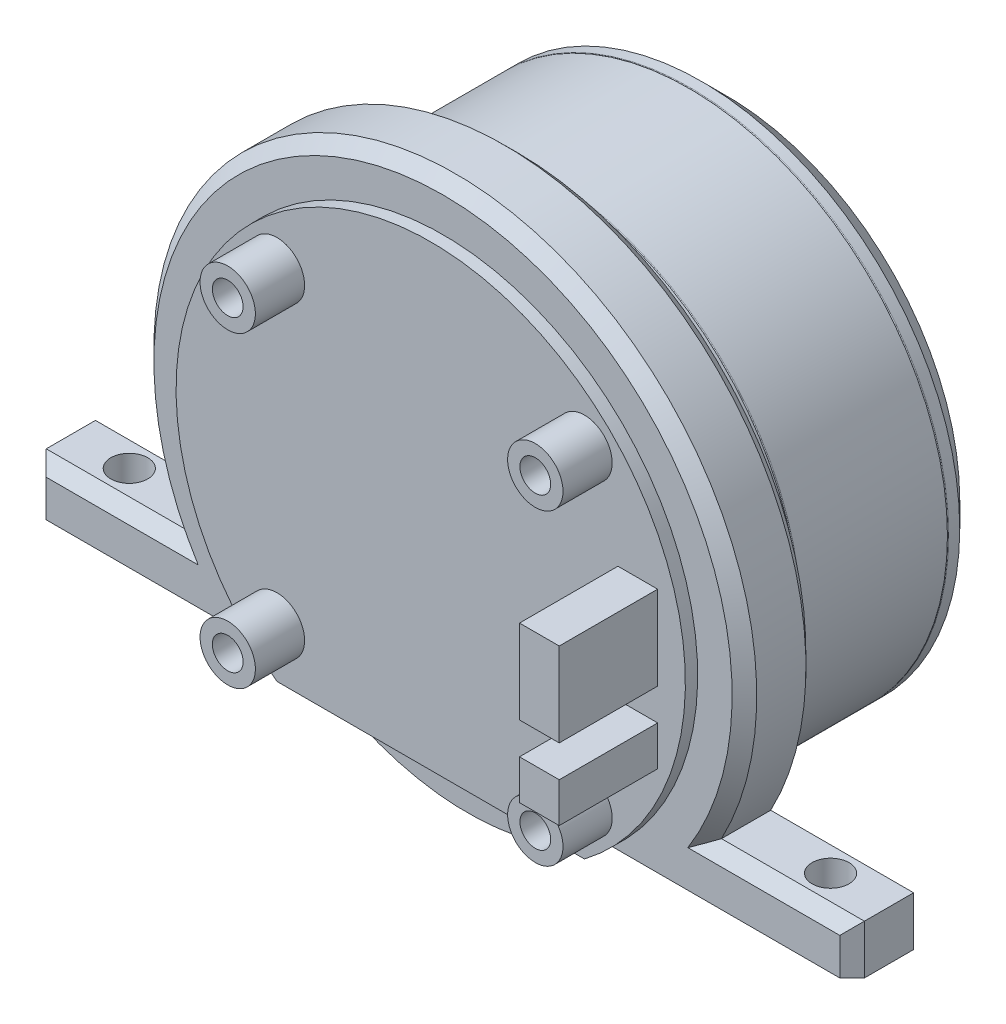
from build123d import *

# Parameters (mm, degrees)
SKETCH1_R               = 21
BOSS_EXTRUDE1_DEPTH     = 3
CHAMFER1_SIZE           = 2
FILLET1_R               = 0.1
SKETCH2_R               = 21
BOSS_EXTRUDE2_DEPTH     = 12
FILLET2_R               = 0.1
SKETCH3_R               = 21
BOSS_EXTRUDE3_DEPTH     = 6
SKETCH4_R               = 3
SKETCH4_R_2             = 1.5
CUT_EXTRUDE1_DEPTH      = 6
BOSS_EXTRUDE4_DEPTH     = 6
CHAMFER2_SIZE           = 1
CUT_EXTRUDE2_DEPTH      = 55.134670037
CUT_EXTRUDE2_DEPTH_BACK = 55.134670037
SKETCH6_R               = 1.5
BOSS_EXTRUDE5_DEPTH     = 1
SKETCH8_R               = 2.25
BOSS_EXTRUDE6_DEPTH     = 4
SKETCH9_R               = 1.25
CUT_EXTRUDE3_DEPTH      = 4
SKETCH10_W              = 3.229244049
SKETCH10_H              = 6.822780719
SKETCH10_H_2            = 3.229244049
BOSS_EXTRUDE7_DEPTH     = 8


with BuildPart() as part:
    # Sketch1 → Boss-Extrude1 (new body)
    with BuildSketch(Plane.XY):
        Circle(SKETCH1_R)
    extrude(amount=BOSS_EXTRUDE1_DEPTH)

    # Chamfer1
    chamfer1_edges = [part.edges().sort_by_distance(p)[0] for p in [
        (-21, 0, 0),
    ]]
    chamfer(chamfer1_edges, length=CHAMFER1_SIZE)

    # Fillet1
    fillet1_edges = [part.edges().sort_by_distance(p)[0] for p in [
        (-21, 0, 3),
    ]]
    fillet(fillet1_edges, radius=FILLET1_R)

    # Sketch2 → Boss-Extrude2 (add)
    with BuildSketch(Plane.XY.offset(3)):
        Circle(SKETCH2_R)
    extrude(amount=BOSS_EXTRUDE2_DEPTH)

    # Fillet2
    fillet2_edges = [part.edges().sort_by_distance(p)[0] for p in [
        (-21, 0, 15),
    ]]
    fillet(fillet2_edges, radius=FILLET2_R)

    # Sketch3 → Boss-Extrude3 (add)
    with BuildSketch(Plane.XY.offset(15)):
        Circle(SKETCH3_R)
    extrude(amount=BOSS_EXTRUDE3_DEPTH)

    # Sketch4 → Cut-Extrude1 (cut)
    with BuildSketch(Plane(origin=(0, 0, 0), x_dir=(-1, 0, 0), z_dir=(0, 0, -1))):
        Circle(SKETCH4_R)
        with Locations((-10, 0)):
            Circle(SKETCH4_R_2)
        with Locations((0, 10)):
            Circle(SKETCH4_R_2)
        with Locations((10, 0)):
            Circle(SKETCH4_R_2)
        with Locations((0, -10)):
            Circle(SKETCH4_R_2)
    extrude(amount=-CUT_EXTRUDE1_DEPTH, mode=Mode.SUBTRACT)

    # Sketch5 → Boss-Extrude4 (add)
    with BuildSketch(Plane.XY.offset(17)):
        with BuildLine():
            Line((21.633307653, -11.5), (33.25, -11.5))
            Line((33.25, -11.5), (33.25, -15.5))
            Line((33.25, -15.5), (-33.25, -15.5))
            Line((-33.25, -15.5), (-33.25, -11.5))
            Line((-33.25, -11.5), (-21.633307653, -11.5))
            ThreePointArc((-21.633307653, -11.5), (0, 24.5), (21.633307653, -11.5))
        make_face()
    extrude(amount=BOSS_EXTRUDE4_DEPTH)

    # Chamfer2
    chamfer2_edges = [part.edges().sort_by_distance(p)[0] for p in [
        (0, 24.5, 17),
        (-27.441653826, -11.5, 17),
        (-33.25, -13.5, 17),
        (33.25, -13.5, 17),
        (27.441653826, -11.5, 17),
        (0, 24.5, 23),
        (-27.441653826, -11.5, 23),
        (-33.25, -13.5, 23),
        (33.25, -13.5, 23),
        (27.441653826, -11.5, 23),
    ]]
    chamfer(chamfer2_edges, length=CHAMFER2_SIZE)

    # Sketch6 → Cut-Extrude2 (cut, two sides: drawn at the far end of the back side and taken through both)
    with BuildSketch(Plane(origin=(0, -11.5, 0), x_dir=(1, 0, 0), z_dir=(0, 1, 0)).offset(-CUT_EXTRUDE2_DEPTH_BACK)):
        with Locations(Location((-28.5, -20, 0), (0, 0, 180))):
            Circle(SKETCH6_R)
        with Locations(Location((28.5, -20, 0), (0, 0, 180))):
            Circle(SKETCH6_R)
    extrude(amount=CUT_EXTRUDE2_DEPTH + CUT_EXTRUDE2_DEPTH_BACK, mode=Mode.SUBTRACT)

    # Sketch7 → Boss-Extrude5 (add)
    with BuildSketch(Plane.XY.offset(23)):
        with BuildLine():
            Line((12.499599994, -16.5), (-12.499599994, -16.5))
            ThreePointArc((-12.499599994, -16.5), (0, 20.7), (12.499599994, -16.5))
        make_face()
    extrude(amount=BOSS_EXTRUDE5_DEPTH)

    # Sketch8 → Boss-Extrude6 (add)
    with BuildSketch(Plane.XY.offset(24)):
        with Locations((-12.5, 12.5)):
            Circle(SKETCH8_R)
        with Locations((12.5, 12.5)):
            Circle(SKETCH8_R)
        with Locations((12.5, -12.5)):
            Circle(SKETCH8_R)
        with Locations((-12.5, -12.5)):
            Circle(SKETCH8_R)
    extrude(amount=BOSS_EXTRUDE6_DEPTH)

    # Sketch9 → Cut-Extrude3 (cut)
    with BuildSketch(Plane.XY.offset(28)):
        with Locations((12.5, 12.5)):
            Circle(SKETCH9_R)
        with Locations((12.5, -12.5)):
            Circle(SKETCH9_R)
        with Locations((-12.5, 12.5)):
            Circle(SKETCH9_R)
        with Locations((-12.5, -12.5)):
            Circle(SKETCH9_R)
    extrude(amount=-CUT_EXTRUDE3_DEPTH, mode=Mode.SUBTRACT)

    # Sketch10 → Boss-Extrude7 (add)
    with BuildSketch(Plane.XY.offset(24)):
        with Locations((16.831288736, 2.056395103)):
            Rectangle(SKETCH10_W, SKETCH10_H)
        with Locations((16.831288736, -5.561216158)):
            Rectangle(SKETCH10_W, SKETCH10_H_2)
    extrude(amount=BOSS_EXTRUDE7_DEPTH)


solid = part.part
